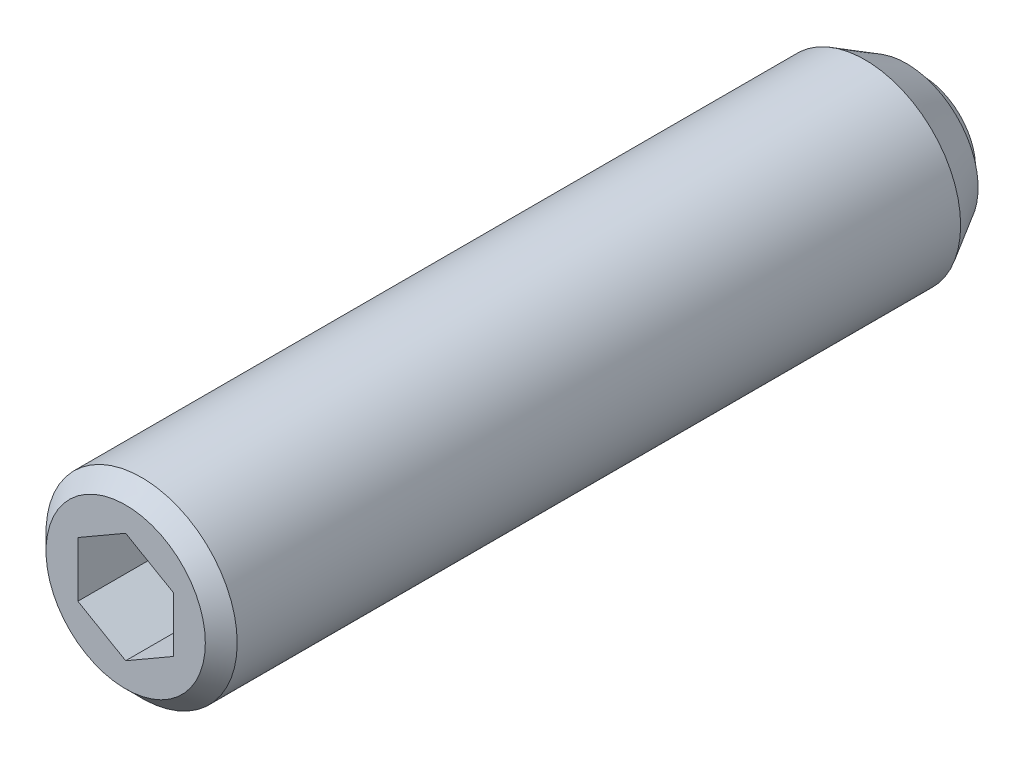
ISO-10303-21;
HEADER;
FILE_DESCRIPTION(('STEP AP214'),'2;1');
FILE_NAME('part.step','',(''),(''),'','','');
FILE_SCHEMA(('AUTOMOTIVE_DESIGN { 1 0 10303 214 1 1 1 1 }'));
ENDSEC;
DATA;
#1=APPLICATION_CONTEXT('core data for automotive mechanical design processes');
#2=APPLICATION_PROTOCOL_DEFINITION('international standard','automotive_design',2000,#1);
#3=PRODUCT_CONTEXT('',#1,'mechanical');
#4=PRODUCT('Part','Part','',(#3));
#5=PRODUCT_RELATED_PRODUCT_CATEGORY('part','',(#4));
#6=PRODUCT_DEFINITION_FORMATION('','',#4);
#7=PRODUCT_DEFINITION_CONTEXT('part definition',#1,'design');
#8=PRODUCT_DEFINITION('design','',#6,#7);
#9=PRODUCT_DEFINITION_SHAPE('','',#8);
#10=(LENGTH_UNIT() NAMED_UNIT(*) SI_UNIT(.MILLI.,.METRE.));
#11=(NAMED_UNIT(*) PLANE_ANGLE_UNIT() SI_UNIT($,.RADIAN.));
#12=(NAMED_UNIT(*) SI_UNIT($,.STERADIAN.) SOLID_ANGLE_UNIT());
#13=UNCERTAINTY_MEASURE_WITH_UNIT(LENGTH_MEASURE(1.E-05),#10,'distance_accuracy_value','');
#14=(GEOMETRIC_REPRESENTATION_CONTEXT(3) GLOBAL_UNCERTAINTY_ASSIGNED_CONTEXT((#13)) GLOBAL_UNIT_ASSIGNED_CONTEXT((#10,
#11,#12)) REPRESENTATION_CONTEXT('',''));
#15=CARTESIAN_POINT('',(0.,0.,0.));
#16=DIRECTION('',(0.,0.,1.));
#17=DIRECTION('',(1.,0.,0.));
#18=AXIS2_PLACEMENT_3D('',#15,#16,#17);
#19=CARTESIAN_POINT('',(1.5,0.866025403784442,22.5));
#20=DIRECTION('',(0.5,0.86602540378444,0.));
#21=DIRECTION('',(0.86602540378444,-0.5,0.));
#22=AXIS2_PLACEMENT_3D('',#19,#20,#21);
#23=PLANE('',#22);
#24=DIRECTION('',(0.,0.,1.));
#25=VECTOR('',#24,1.);
#26=CARTESIAN_POINT('',(1.5,0.866025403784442,22.5));
#27=LINE('',#26,#25);
#28=CARTESIAN_POINT('',(1.5,0.866025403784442,22.));
#29=VERTEX_POINT('',#28);
#30=CARTESIAN_POINT('',(1.5,0.866025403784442,25.));
#31=VERTEX_POINT('',#30);
#32=EDGE_CURVE('E68',#29,#31,#27,.T.);
#33=ORIENTED_EDGE('',*,*,#32,.T.);
#34=DIRECTION('',(-0.86602540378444,0.5,0.));
#35=VECTOR('',#34,1.);
#36=CARTESIAN_POINT('',(1.5,0.866025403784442,25.));
#37=LINE('',#36,#35);
#38=CARTESIAN_POINT('',(0.,1.73205080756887,25.));
#39=VERTEX_POINT('',#38);
#40=EDGE_CURVE('E29',#31,#39,#37,.T.);
#41=ORIENTED_EDGE('',*,*,#40,.T.);
#42=DIRECTION('',(0.,0.,1.));
#43=VECTOR('',#42,1.);
#44=CARTESIAN_POINT('',(0.,1.73205080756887,22.5));
#45=LINE('',#44,#43);
#46=CARTESIAN_POINT('',(0.,1.73205080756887,22.));
#47=VERTEX_POINT('',#46);
#48=EDGE_CURVE('E80',#47,#39,#45,.T.);
#49=ORIENTED_EDGE('',*,*,#48,.F.);
#50=DIRECTION('',(-0.86602540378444,0.5,0.));
#51=VECTOR('',#50,1.);
#52=CARTESIAN_POINT('',(1.5,0.866025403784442,22.));
#53=LINE('',#52,#51);
#54=EDGE_CURVE('E79',#29,#47,#53,.T.);
#55=ORIENTED_EDGE('',*,*,#54,.F.);
#56=EDGE_LOOP('',(#33,#41,#49,#55));
#57=FACE_BOUND('',#56,.T.);
#58=ADVANCED_FACE('F14',(#57),#23,.F.);
#59=CARTESIAN_POINT('',(1.5,-0.866025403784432,22.5));
#60=DIRECTION('',(1.,0.,0.));
#61=DIRECTION('',(0.,-1.,0.));
#62=AXIS2_PLACEMENT_3D('',#59,#60,#61);
#63=PLANE('',#62);
#64=DIRECTION('',(0.,0.,1.));
#65=VECTOR('',#64,1.);
#66=CARTESIAN_POINT('',(1.5,-0.866025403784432,22.5));
#67=LINE('',#66,#65);
#68=CARTESIAN_POINT('',(1.5,-0.866025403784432,22.));
#69=VERTEX_POINT('',#68);
#70=CARTESIAN_POINT('',(1.5,-0.866025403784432,25.));
#71=VERTEX_POINT('',#70);
#72=EDGE_CURVE('E76',#69,#71,#67,.T.);
#73=ORIENTED_EDGE('',*,*,#72,.T.);
#74=DIRECTION('',(0.,1.,0.));
#75=VECTOR('',#74,1.);
#76=CARTESIAN_POINT('',(1.5,-0.866025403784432,25.));
#77=LINE('',#76,#75);
#78=EDGE_CURVE('E75',#71,#31,#77,.T.);
#79=ORIENTED_EDGE('',*,*,#78,.T.);
#80=ORIENTED_EDGE('',*,*,#32,.F.);
#81=DIRECTION('',(0.,1.,0.));
#82=VECTOR('',#81,1.);
#83=CARTESIAN_POINT('',(1.5,-0.866025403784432,22.));
#84=LINE('',#83,#82);
#85=EDGE_CURVE('E72',#69,#29,#84,.T.);
#86=ORIENTED_EDGE('',*,*,#85,.F.);
#87=EDGE_LOOP('',(#73,#79,#80,#86));
#88=FACE_BOUND('',#87,.T.);
#89=ADVANCED_FACE('F70',(#88),#63,.F.);
#90=CARTESIAN_POINT('',(1.5,-0.866025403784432,22.5));
#91=DIRECTION('',(-0.5,0.866025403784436,0.));
#92=DIRECTION('',(0.866025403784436,0.5,0.));
#93=AXIS2_PLACEMENT_3D('',#90,#91,#92);
#94=PLANE('',#93);
#95=DIRECTION('',(0.,0.,1.));
#96=VECTOR('',#95,1.);
#97=CARTESIAN_POINT('',(0.,-1.73205080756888,22.5));
#98=LINE('',#97,#96);
#99=CARTESIAN_POINT('',(0.,-1.73205080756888,22.));
#100=VERTEX_POINT('',#99);
#101=CARTESIAN_POINT('',(0.,-1.73205080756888,25.));
#102=VERTEX_POINT('',#101);
#103=EDGE_CURVE('E122',#100,#102,#98,.T.);
#104=ORIENTED_EDGE('',*,*,#103,.T.);
#105=DIRECTION('',(-0.866025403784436,-0.5,0.));
#106=VECTOR('',#105,1.);
#107=CARTESIAN_POINT('',(1.5,-0.866025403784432,25.));
#108=LINE('',#107,#106);
#109=EDGE_CURVE('E113',#71,#102,#108,.T.);
#110=ORIENTED_EDGE('',*,*,#109,.F.);
#111=ORIENTED_EDGE('',*,*,#72,.F.);
#112=DIRECTION('',(0.866025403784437,0.5,0.));
#113=VECTOR('',#112,1.);
#114=CARTESIAN_POINT('',(0.,-1.73205080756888,22.));
#115=LINE('',#114,#113);
#116=EDGE_CURVE('E89',#100,#69,#115,.T.);
#117=ORIENTED_EDGE('',*,*,#116,.F.);
#118=EDGE_LOOP('',(#104,#110,#111,#117));
#119=FACE_BOUND('',#118,.T.);
#120=ADVANCED_FACE('F147',(#119),#94,.T.);
#121=CARTESIAN_POINT('',(-1.5,-0.866025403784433,22.5));
#122=DIRECTION('',(-0.5,-0.866025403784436,0.));
#123=DIRECTION('',(-0.866025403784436,0.5,0.));
#124=AXIS2_PLACEMENT_3D('',#121,#122,#123);
#125=PLANE('',#124);
#126=DIRECTION('',(0.,0.,1.));
#127=VECTOR('',#126,1.);
#128=CARTESIAN_POINT('',(-1.5,-0.866025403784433,22.5));
#129=LINE('',#128,#127);
#130=CARTESIAN_POINT('',(-1.5,-0.866025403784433,22.));
#131=VERTEX_POINT('',#130);
#132=CARTESIAN_POINT('',(-1.5,-0.866025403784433,25.));
#133=VERTEX_POINT('',#132);
#134=EDGE_CURVE('E120',#131,#133,#129,.T.);
#135=ORIENTED_EDGE('',*,*,#134,.T.);
#136=DIRECTION('',(0.866025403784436,-0.5,0.));
#137=VECTOR('',#136,1.);
#138=CARTESIAN_POINT('',(-1.5,-0.866025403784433,25.));
#139=LINE('',#138,#137);
#140=EDGE_CURVE('E111',#133,#102,#139,.T.);
#141=ORIENTED_EDGE('',*,*,#140,.T.);
#142=ORIENTED_EDGE('',*,*,#103,.F.);
#143=DIRECTION('',(0.866025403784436,-0.5,0.));
#144=VECTOR('',#143,1.);
#145=CARTESIAN_POINT('',(-1.5,-0.866025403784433,22.));
#146=LINE('',#145,#144);
#147=EDGE_CURVE('E101',#131,#100,#146,.T.);
#148=ORIENTED_EDGE('',*,*,#147,.F.);
#149=EDGE_LOOP('',(#135,#141,#142,#148));
#150=FACE_BOUND('',#149,.T.);
#151=ADVANCED_FACE('F157',(#150),#125,.F.);
#152=CARTESIAN_POINT('',(-1.5,-0.866025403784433,22.5));
#153=DIRECTION('',(1.,0.,0.));
#154=DIRECTION('',(0.,-1.,0.));
#155=AXIS2_PLACEMENT_3D('',#152,#153,#154);
#156=PLANE('',#155);
#157=DIRECTION('',(0.,0.,1.));
#158=VECTOR('',#157,1.);
#159=CARTESIAN_POINT('',(-1.5,0.866025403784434,22.5));
#160=LINE('',#159,#158);
#161=CARTESIAN_POINT('',(-1.5,0.866025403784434,22.));
#162=VERTEX_POINT('',#161);
#163=CARTESIAN_POINT('',(-1.5,0.866025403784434,25.));
#164=VERTEX_POINT('',#163);
#165=EDGE_CURVE('E37',#162,#164,#160,.T.);
#166=ORIENTED_EDGE('',*,*,#165,.T.);
#167=DIRECTION('',(0.,1.,0.));
#168=VECTOR('',#167,1.);
#169=CARTESIAN_POINT('',(-1.5,-0.866025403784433,25.));
#170=LINE('',#169,#168);
#171=EDGE_CURVE('E108',#133,#164,#170,.T.);
#172=ORIENTED_EDGE('',*,*,#171,.F.);
#173=ORIENTED_EDGE('',*,*,#134,.F.);
#174=DIRECTION('',(0.,-1.,0.));
#175=VECTOR('',#174,1.);
#176=CARTESIAN_POINT('',(-1.5,0.866025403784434,22.));
#177=LINE('',#176,#175);
#178=EDGE_CURVE('E98',#162,#131,#177,.T.);
#179=ORIENTED_EDGE('',*,*,#178,.F.);
#180=EDGE_LOOP('',(#166,#172,#173,#179));
#181=FACE_BOUND('',#180,.T.);
#182=ADVANCED_FACE('F153',(#181),#156,.T.);
#183=CARTESIAN_POINT('',(-1.5,0.866025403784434,22.5));
#184=DIRECTION('',(0.5,-0.866025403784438,0.));
#185=DIRECTION('',(-0.866025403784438,-0.5,0.));
#186=AXIS2_PLACEMENT_3D('',#183,#184,#185);
#187=PLANE('',#186);
#188=ORIENTED_EDGE('',*,*,#165,.F.);
#189=DIRECTION('',(-0.866025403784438,-0.5,0.));
#190=VECTOR('',#189,1.);
#191=CARTESIAN_POINT('',(0.,1.73205080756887,22.));
#192=LINE('',#191,#190);
#193=EDGE_CURVE('E84',#47,#162,#192,.T.);
#194=ORIENTED_EDGE('',*,*,#193,.F.);
#195=ORIENTED_EDGE('',*,*,#48,.T.);
#196=DIRECTION('',(0.866025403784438,0.5,0.));
#197=VECTOR('',#196,1.);
#198=CARTESIAN_POINT('',(-1.5,0.866025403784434,25.));
#199=LINE('',#198,#197);
#200=EDGE_CURVE('E105',#164,#39,#199,.T.);
#201=ORIENTED_EDGE('',*,*,#200,.F.);
#202=EDGE_LOOP('',(#188,#194,#195,#201));
#203=FACE_BOUND('',#202,.T.);
#204=ADVANCED_FACE('F150',(#203),#187,.T.);
#205=CARTESIAN_POINT('',(0.,0.,24.75));
#206=DIRECTION('',(0.,0.,-1.));
#207=DIRECTION('',(1.,0.,0.));
#208=AXIS2_PLACEMENT_3D('',#205,#206,#207);
#209=CYLINDRICAL_SURFACE('',#208,3.);
#210=CARTESIAN_POINT('',(0.,0.,24.5));
#211=DIRECTION('',(0.,0.,-1.));
#212=DIRECTION('',(1.,0.,0.));
#213=AXIS2_PLACEMENT_3D('',#210,#211,#212);
#214=CIRCLE('',#213,3.);
#215=CARTESIAN_POINT('',(3.,0.,24.5));
#216=VERTEX_POINT('',#215);
#217=EDGE_CURVE('E9',#216,#216,#214,.T.);
#218=ORIENTED_EDGE('',*,*,#217,.T.);
#219=EDGE_LOOP('',(#218));
#220=FACE_BOUND('',#219,.T.);
#221=CARTESIAN_POINT('',(0.,0.,1.79903810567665));
#222=DIRECTION('',(0.,0.,-1.));
#223=DIRECTION('',(-1.,0.,0.));
#224=AXIS2_PLACEMENT_3D('',#221,#222,#223);
#225=CIRCLE('',#224,3.);
#226=CARTESIAN_POINT('',(-3.,0.,1.79903810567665));
#227=VERTEX_POINT('',#226);
#228=EDGE_CURVE('E260',#227,#227,#225,.T.);
#229=ORIENTED_EDGE('',*,*,#228,.F.);
#230=EDGE_LOOP('',(#229));
#231=FACE_BOUND('',#230,.T.);
#232=ADVANCED_FACE('F16',(#220,#231),#209,.T.);
#233=CARTESIAN_POINT('',(0.,0.,24.5));
#234=DIRECTION('',(0.,0.,-1.));
#235=DIRECTION('',(1.,0.,0.));
#236=AXIS2_PLACEMENT_3D('',#233,#234,#235);
#237=CONICAL_SURFACE('',#236,3.,0.785398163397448);
#238=CARTESIAN_POINT('',(0.,0.,25.));
#239=DIRECTION('',(0.,0.,-1.));
#240=DIRECTION('',(1.,0.,0.));
#241=AXIS2_PLACEMENT_3D('',#238,#239,#240);
#242=CIRCLE('',#241,2.5);
#243=CARTESIAN_POINT('',(2.5,0.,25.));
#244=VERTEX_POINT('',#243);
#245=EDGE_CURVE('E22',#244,#244,#242,.T.);
#246=ORIENTED_EDGE('',*,*,#245,.T.);
#247=EDGE_LOOP('',(#246));
#248=FACE_BOUND('',#247,.T.);
#249=ORIENTED_EDGE('',*,*,#217,.F.);
#250=EDGE_LOOP('',(#249));
#251=FACE_BOUND('',#250,.T.);
#252=ADVANCED_FACE('F127',(#248,#251),#237,.T.);
#253=CARTESIAN_POINT('',(0.,0.,25.));
#254=DIRECTION('',(0.,0.,-1.));
#255=DIRECTION('',(1.,0.,0.));
#256=AXIS2_PLACEMENT_3D('',#253,#254,#255);
#257=PLANE('',#256);
#258=ORIENTED_EDGE('',*,*,#200,.T.);
#259=ORIENTED_EDGE('',*,*,#40,.F.);
#260=ORIENTED_EDGE('',*,*,#78,.F.);
#261=ORIENTED_EDGE('',*,*,#109,.T.);
#262=ORIENTED_EDGE('',*,*,#140,.F.);
#263=ORIENTED_EDGE('',*,*,#171,.T.);
#264=EDGE_LOOP('',(#258,#259,#260,#261,#262,#263));
#265=FACE_BOUND('',#264,.T.);
#266=ORIENTED_EDGE('',*,*,#245,.F.);
#267=EDGE_LOOP('',(#266));
#268=FACE_BOUND('',#267,.T.);
#269=ADVANCED_FACE('F130',(#265,#268),#257,.F.);
#270=CARTESIAN_POINT('',(1.5,0.866025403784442,22.));
#271=DIRECTION('',(0.,0.,1.));
#272=DIRECTION('',(1.,0.,0.));
#273=AXIS2_PLACEMENT_3D('',#270,#271,#272);
#274=PLANE('',#273);
#275=ORIENTED_EDGE('',*,*,#85,.T.);
#276=ORIENTED_EDGE('',*,*,#54,.T.);
#277=ORIENTED_EDGE('',*,*,#193,.T.);
#278=ORIENTED_EDGE('',*,*,#178,.T.);
#279=ORIENTED_EDGE('',*,*,#147,.T.);
#280=ORIENTED_EDGE('',*,*,#116,.T.);
#281=EDGE_LOOP('',(#275,#276,#277,#278,#279,#280));
#282=FACE_BOUND('',#281,.T.);
#283=ADVANCED_FACE('F86',(#282),#274,.T.);
#284=CARTESIAN_POINT('',(0.,0.,0.));
#285=DIRECTION('',(0.,0.,-1.));
#286=DIRECTION('',(-1.,0.,0.));
#287=AXIS2_PLACEMENT_3D('',#284,#285,#286);
#288=PLANE('',#287);
#289=CARTESIAN_POINT('',(0.,0.,0.));
#290=DIRECTION('',(0.,0.,-1.));
#291=DIRECTION('',(-1.,0.,0.));
#292=AXIS2_PLACEMENT_3D('',#289,#290,#291);
#293=CIRCLE('',#292,1.670329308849);
#294=CARTESIAN_POINT('',(-1.67032930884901,0.,0.));
#295=VERTEX_POINT('',#294);
#296=EDGE_CURVE('E90',#295,#295,#293,.T.);
#297=ORIENTED_EDGE('',*,*,#296,.T.);
#298=EDGE_LOOP('',(#297));
#299=FACE_BOUND('',#298,.T.);
#300=ADVANCED_FACE('F139',(#299),#288,.T.);
#301=CARTESIAN_POINT('',(0.,0.,1.1));
#302=DIRECTION('',(0.,0.,-1.));
#303=DIRECTION('',(-1.,0.,0.));
#304=AXIS2_PLACEMENT_3D('',#301,#302,#303);
#305=SPHERICAL_SURFACE('',#304,2.);
#306=CARTESIAN_POINT('',(0.,0.,0.5));
#307=DIRECTION('',(0.,0.,-1.));
#308=DIRECTION('',(-1.,0.,0.));
#309=AXIS2_PLACEMENT_3D('',#306,#307,#308);
#310=CIRCLE('',#309,1.90787840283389);
#311=CARTESIAN_POINT('',(-1.90787840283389,0.,0.5));
#312=VERTEX_POINT('',#311);
#313=EDGE_CURVE('E93',#312,#312,#310,.T.);
#314=CARTESIAN_POINT('',(-1.90787840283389,0.,0.5));
#315=CARTESIAN_POINT('',(-1.90614295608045,0.,0.494481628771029));
#316=CARTESIAN_POINT('',(-1.90438356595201,0.,0.488970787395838));
#317=CARTESIAN_POINT('',(-1.90081703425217,0.,0.477964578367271));
#318=CARTESIAN_POINT('',(-1.89900989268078,0.,0.472469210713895));
#319=CARTESIAN_POINT('',(-1.8953479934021,0.,0.46149436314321));
#320=CARTESIAN_POINT('',(-1.89349323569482,0.,0.456014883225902));
#321=CARTESIAN_POINT('',(-1.88973624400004,0.,0.445072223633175));
#322=CARTESIAN_POINT('',(-1.88783401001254,0.,0.439609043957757));
#323=CARTESIAN_POINT('',(-1.8839822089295,0.,0.428699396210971));
#324=CARTESIAN_POINT('',(-1.88203264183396,0.,0.423252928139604));
#325=CARTESIAN_POINT('',(-1.87808632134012,0.,0.412377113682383));
#326=CARTESIAN_POINT('',(-1.87608956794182,0.,0.40694776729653));
#327=CARTESIAN_POINT('',(-1.87204902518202,0.,0.396106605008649));
#328=CARTESIAN_POINT('',(-1.87000523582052,0.,0.39069478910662));
#329=CARTESIAN_POINT('',(-1.86587077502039,0.,0.379889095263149));
#330=CARTESIAN_POINT('',(-1.86378010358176,0.,0.374495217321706));
#331=CARTESIAN_POINT('',(-1.85955203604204,0.,0.363725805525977));
#332=CARTESIAN_POINT('',(-1.85741463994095,0.,0.358350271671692));
#333=CARTESIAN_POINT('',(-1.85309328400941,0.,0.347617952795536));
#334=CARTESIAN_POINT('',(-1.85090932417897,0.,0.342261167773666));
#335=CARTESIAN_POINT('',(-1.84649500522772,0.,0.331566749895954));
#336=CARTESIAN_POINT('',(-1.84426464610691,0.,0.326229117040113));
#337=CARTESIAN_POINT('',(-1.83975769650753,0.,0.315573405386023));
#338=CARTESIAN_POINT('',(-1.83748110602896,0.,0.310255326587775));
#339=CARTESIAN_POINT('',(-1.83288186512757,0.,0.299639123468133));
#340=CARTESIAN_POINT('',(-1.83055921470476,0.,0.29434099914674));
#341=CARTESIAN_POINT('',(-1.82586802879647,0.,0.283765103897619));
#342=CARTESIAN_POINT('',(-1.823499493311,0.,0.278487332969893));
#343=CARTESIAN_POINT('',(-1.81871671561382,0.,0.267952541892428));
#344=CARTESIAN_POINT('',(-1.81630247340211,0.,0.26269552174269));
#345=CARTESIAN_POINT('',(-1.81142846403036,0.,0.252202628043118));
#346=CARTESIAN_POINT('',(-1.80896869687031,0.,0.246966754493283));
#347=CARTESIAN_POINT('',(-1.80400382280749,0.,0.236516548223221));
#348=CARTESIAN_POINT('',(-1.80149871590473,0.,0.231302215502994));
#349=CARTESIAN_POINT('',(-1.79644335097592,0.,0.220895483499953));
#350=CARTESIAN_POINT('',(-1.79389309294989,0.,0.215703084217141));
#351=CARTESIAN_POINT('',(-1.78874761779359,0.,0.205340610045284));
#352=CARTESIAN_POINT('',(-1.78615240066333,0.,0.200170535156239));
#353=CARTESIAN_POINT('',(-1.78091720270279,0.,0.189853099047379));
#354=CARTESIAN_POINT('',(-1.77827722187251,0.,0.184705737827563));
#355=CARTESIAN_POINT('',(-1.77295269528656,0.,0.174434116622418));
#356=CARTESIAN_POINT('',(-1.77026814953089,0.,0.16930985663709));
#357=CARTESIAN_POINT('',(-1.76485469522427,0.,0.159084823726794));
#358=CARTESIAN_POINT('',(-1.76212578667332,0.,0.153984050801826));
#359=CARTESIAN_POINT('',(-1.7566238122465,0.,0.143806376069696));
#360=CARTESIAN_POINT('',(-1.75385074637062,0.,0.138729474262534));
#361=CARTESIAN_POINT('',(-1.7482606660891,0.,0.128599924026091));
#362=CARTESIAN_POINT('',(-1.74544365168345,0.,0.123547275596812));
#363=CARTESIAN_POINT('',(-1.73976588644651,0.,0.113466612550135));
#364=CARTESIAN_POINT('',(-1.73690513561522,0.,0.108438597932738));
#365=CARTESIAN_POINT('',(-1.73114011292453,0.,0.0984075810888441));
#366=CARTESIAN_POINT('',(-1.72823584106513,0.,0.0934045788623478));
#367=CARTESIAN_POINT('',(-1.72238399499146,0.,0.0834239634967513));
#368=CARTESIAN_POINT('',(-1.71943642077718,0.,0.0784463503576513));
#369=CARTESIAN_POINT('',(-1.71349819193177,0.,0.0685168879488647));
#370=CARTESIAN_POINT('',(-1.71050753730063,0.,0.0635650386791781));
#371=CARTESIAN_POINT('',(-1.70448337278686,0.,0.0536874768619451));
#372=CARTESIAN_POINT('',(-1.70144986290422,0.,0.0487617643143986));
#373=CARTESIAN_POINT('',(-1.6953402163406,0.,0.0389368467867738));
#374=CARTESIAN_POINT('',(-1.69226407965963,0.,0.0340376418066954));
#375=CARTESIAN_POINT('',(-1.68606941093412,0.,0.0242661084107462));
#376=CARTESIAN_POINT('',(-1.68295087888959,0.,0.0193937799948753));
#377=CARTESIAN_POINT('',(-1.67667165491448,0.,0.00967636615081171));
#378=CARTESIAN_POINT('',(-1.67351096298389,0.,0.00483128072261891));
#379=CARTESIAN_POINT('',(-1.67032930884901,0.,0.));
#380=B_SPLINE_CURVE_WITH_KNOTS('',3,(#314,#315,#316,#317,#318,#319,#320,#321,#322,#323,#324,
#325,#326,#327,#328,#329,#330,#331,#332,#333,#334,#335,#336,#337,#338,#339,#340,#341,#342,#343,
#344,#345,#346,#347,#348,#349,#350,#351,#352,#353,#354,#355,#356,#357,#358,#359,#360,#361,#362,
#363,#364,#365,#366,#367,#368,#369,#370,#371,#372,#373,#374,#375,#376,#377,#378,#379),
.UNSPECIFIED.,.F.,.F.,(4,2,2,2,2,2,2,2,2,2,2,2,2,2,2,2,2,2,2,2,2,2,2,2,2,2,2,2,2,2,2,2,4),(0.,
0.0173544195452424,0.0347088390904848,0.0520632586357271,0.0694176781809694,0.0867720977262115,
0.104126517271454,0.121480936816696,0.138835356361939,0.156189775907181,0.173544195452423,
0.190898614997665,0.208253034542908,0.22560745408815,0.242961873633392,0.260316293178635,
0.277670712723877,0.295025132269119,0.312379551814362,0.329733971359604,0.347088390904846,
0.364442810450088,0.381797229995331,0.399151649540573,0.416506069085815,0.433860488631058,
0.4512149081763,0.468569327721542,0.485923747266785,0.503278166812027,0.520632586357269,
0.537987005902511,0.555341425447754),.UNSPECIFIED.);
#381=EDGE_CURVE('BSEAM223',#312,#295,#380,.T.);
#382=ORIENTED_EDGE('',*,*,#313,.T.);
#383=ORIENTED_EDGE('',*,*,#296,.F.);
#384=ORIENTED_EDGE('',*,*,#381,.T.);
#385=ORIENTED_EDGE('',*,*,#381,.F.);
#386=EDGE_LOOP('',(#382,#384,#383,#385));
#387=FACE_BOUND('',#386,.T.);
#388=ADVANCED_FACE('F223',(#387),#305,.T.);
#389=CARTESIAN_POINT('',(-1.90787840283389,0.,0.5));
#390=DIRECTION('',(0.,0.,-1.));
#391=DIRECTION('',(-1.,0.,0.));
#392=AXIS2_PLACEMENT_3D('',#389,#390,#391);
#393=PLANE('',#392);
#394=CARTESIAN_POINT('',(0.,0.,0.5));
#395=DIRECTION('',(0.,0.,-1.));
#396=DIRECTION('',(-1.,0.,0.));
#397=AXIS2_PLACEMENT_3D('',#394,#395,#396);
#398=CIRCLE('',#397,2.25);
#399=CARTESIAN_POINT('',(-2.25,0.,0.5));
#400=VERTEX_POINT('',#399);
#401=EDGE_CURVE('E263',#400,#400,#398,.T.);
#402=ORIENTED_EDGE('',*,*,#401,.T.);
#403=EDGE_LOOP('',(#402));
#404=FACE_BOUND('',#403,.T.);
#405=ORIENTED_EDGE('',*,*,#313,.F.);
#406=EDGE_LOOP('',(#405));
#407=FACE_BOUND('',#406,.T.);
#408=ADVANCED_FACE('F232',(#404,#407),#393,.T.);
#409=CARTESIAN_POINT('',(0.,0.,0.5));
#410=DIRECTION('',(0.,0.,1.));
#411=DIRECTION('',(1.,0.,0.));
#412=AXIS2_PLACEMENT_3D('',#409,#410,#411);
#413=CONICAL_SURFACE('',#412,2.25,0.523598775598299);
#414=ORIENTED_EDGE('',*,*,#228,.T.);
#415=EDGE_LOOP('',(#414));
#416=FACE_BOUND('',#415,.T.);
#417=ORIENTED_EDGE('',*,*,#401,.F.);
#418=EDGE_LOOP('',(#417));
#419=FACE_BOUND('',#418,.T.);
#420=ADVANCED_FACE('F242',(#416,#419),#413,.T.);
#421=CLOSED_SHELL('',(#58,#89,#120,#151,#182,#204,#232,#252,#269,#283,#300,#388,#408,#420));
#422=MANIFOLD_SOLID_BREP('B1',#421);
#423=ADVANCED_BREP_SHAPE_REPRESENTATION('',(#18,#422),#14);
#424=SHAPE_DEFINITION_REPRESENTATION(#9,#423);
ENDSEC;
END-ISO-10303-21;
